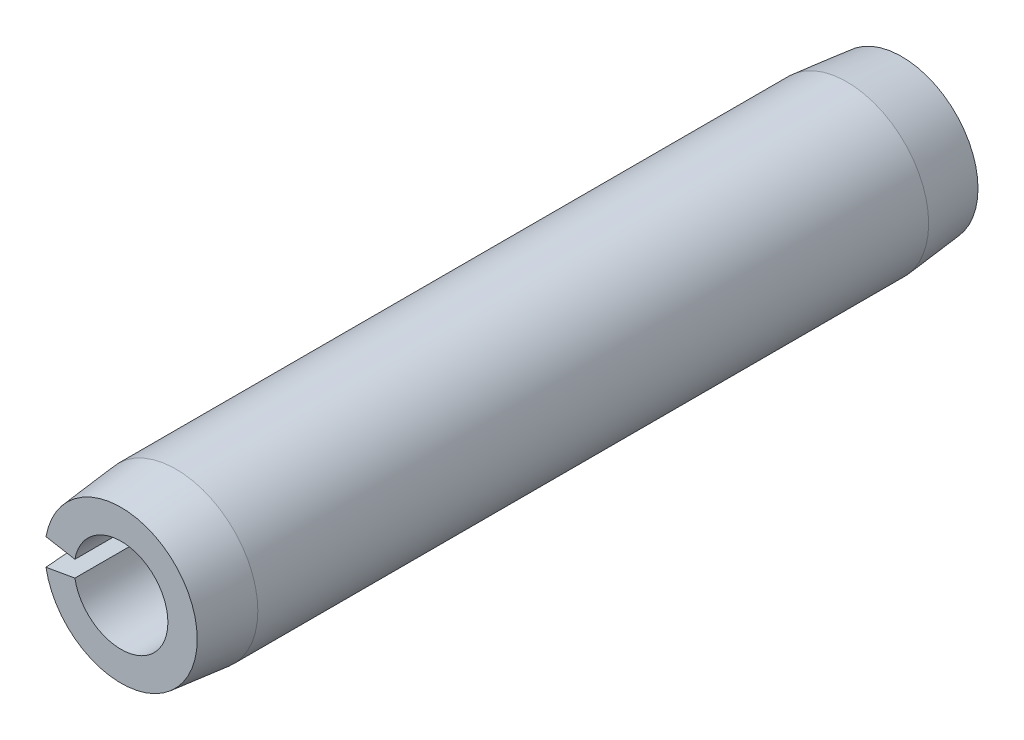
from build123d import *

# Parameters (mm, degrees)
EXTRUDE1_DEPTH = 7.9375


with BuildPart() as part:
    # Sketch1 → Extrude1 (new, symmetric)
    with BuildSketch(Plane.XY):
        with BuildLine():
            Line((-1.638424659, 0.288898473), (-0.938029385, 0.165399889))
            ThreePointArc((-0.938029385, 0.165399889), (0.9525, 0), (-0.938029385, -0.165399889))
            Line((-0.938029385, -0.165399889), (-1.638424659, -0.288898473))
            ThreePointArc((-1.638424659, -0.288898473), (1.6637, 0), (-1.638424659, 0.288898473))
        make_face()
    extrude(amount=EXTRUDE1_DEPTH, both=True)

    # Sketch2 → Cut-Revolve1 (revolve, cut)
    with BuildSketch(Plane(origin=(0, 0, 0), x_dir=(0, 0, -1), z_dir=(1, 0, 0))):
        Polygon((7.9375, 1.6637), (7.9375, 1.5494), (6.8199, 1.6637), align=None)
        Polygon((-6.8199, 1.6637), (-7.9375, 1.6637), (-7.9375, 1.5494), align=None)
    revolve(axis=Axis((0, 0, -7.9375), (0, 0, 1)), mode=Mode.SUBTRACT)


solid = part.part
